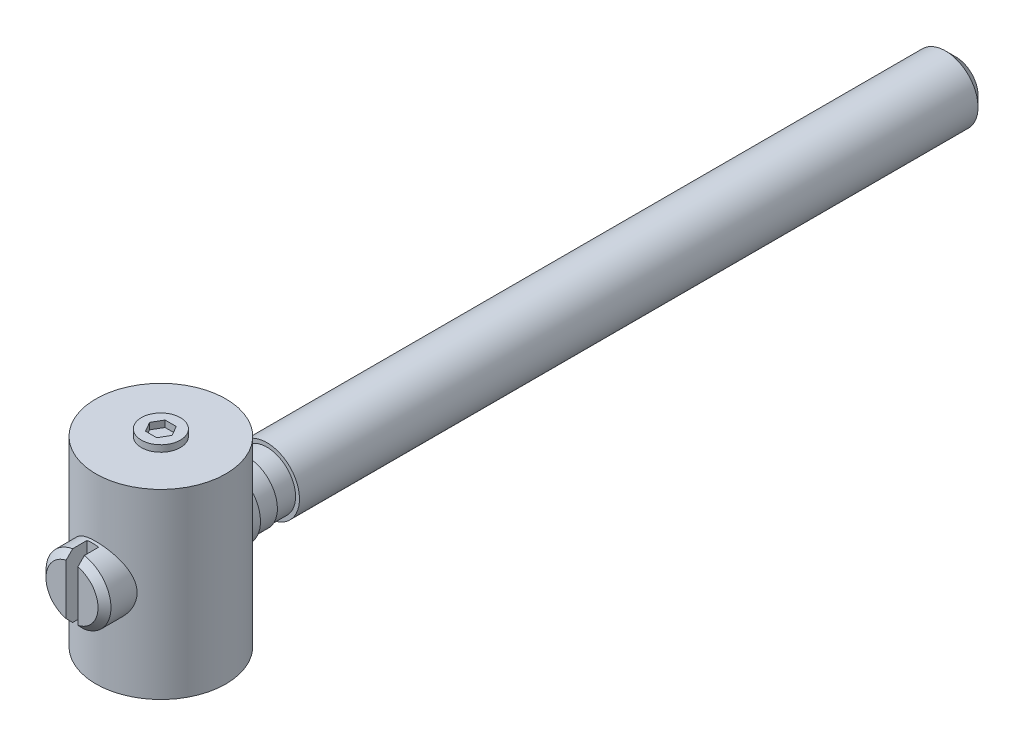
ISO-10303-21;
HEADER;
FILE_DESCRIPTION(('STEP AP214'),'2;1');
FILE_NAME('part.step','',(''),(''),'','','');
FILE_SCHEMA(('AUTOMOTIVE_DESIGN { 1 0 10303 214 1 1 1 1 }'));
ENDSEC;
DATA;
#1=APPLICATION_CONTEXT('core data for automotive mechanical design processes');
#2=APPLICATION_PROTOCOL_DEFINITION('international standard','automotive_design',2000,#1);
#3=PRODUCT_CONTEXT('',#1,'mechanical');
#4=PRODUCT('Part','Part','',(#3));
#5=PRODUCT_RELATED_PRODUCT_CATEGORY('part','',(#4));
#6=PRODUCT_DEFINITION_FORMATION('','',#4);
#7=PRODUCT_DEFINITION_CONTEXT('part definition',#1,'design');
#8=PRODUCT_DEFINITION('design','',#6,#7);
#9=PRODUCT_DEFINITION_SHAPE('','',#8);
#10=(LENGTH_UNIT() NAMED_UNIT(*) SI_UNIT(.MILLI.,.METRE.));
#11=(NAMED_UNIT(*) PLANE_ANGLE_UNIT() SI_UNIT($,.RADIAN.));
#12=(NAMED_UNIT(*) SI_UNIT($,.STERADIAN.) SOLID_ANGLE_UNIT());
#13=UNCERTAINTY_MEASURE_WITH_UNIT(LENGTH_MEASURE(1.E-05),#10,'distance_accuracy_value','');
#14=(GEOMETRIC_REPRESENTATION_CONTEXT(3) GLOBAL_UNCERTAINTY_ASSIGNED_CONTEXT((#13)) GLOBAL_UNIT_ASSIGNED_CONTEXT((#10,
#11,#12)) REPRESENTATION_CONTEXT('',''));
#15=CARTESIAN_POINT('',(0.,0.,0.));
#16=DIRECTION('',(0.,0.,1.));
#17=DIRECTION('',(1.,0.,0.));
#18=AXIS2_PLACEMENT_3D('',#15,#16,#17);
#19=CARTESIAN_POINT('',(0.,0.,6.8376561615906));
#20=DIRECTION('',(0.,0.,-1.));
#21=DIRECTION('',(0.,1.,0.));
#22=AXIS2_PLACEMENT_3D('',#19,#20,#21);
#23=PLANE('',#22);
#24=CARTESIAN_POINT('',(0.,0.,6.8376561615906));
#25=DIRECTION('',(0.,0.,-1.));
#26=DIRECTION('',(0.,1.,0.));
#27=AXIS2_PLACEMENT_3D('',#24,#25,#26);
#28=CIRCLE('',#27,2.);
#29=CARTESIAN_POINT('',(0.45,-1.94871752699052,6.8376561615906));
#30=VERTEX_POINT('',#29);
#31=CARTESIAN_POINT('',(0.45,1.94871752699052,6.8376561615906));
#32=VERTEX_POINT('',#31);
#33=EDGE_CURVE('E145',#30,#32,#28,.F.);
#34=ORIENTED_EDGE('',*,*,#33,.T.);
#35=DIRECTION('',(0.,1.,0.));
#36=VECTOR('',#35,1.);
#37=CARTESIAN_POINT('',(0.45,2.4591665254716,6.8376561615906));
#38=LINE('',#37,#36);
#39=EDGE_CURVE('E33',#30,#32,#38,.T.);
#40=ORIENTED_EDGE('',*,*,#39,.F.);
#41=EDGE_LOOP('',(#34,#40));
#42=FACE_BOUND('',#41,.T.);
#43=ADVANCED_FACE('F14',(#42),#23,.F.);
#44=CARTESIAN_POINT('',(-0.45,1.94871752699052,6.8376561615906));
#45=VERTEX_POINT('',#44);
#46=CARTESIAN_POINT('',(-0.45,-1.94871752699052,6.8376561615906));
#47=VERTEX_POINT('',#46);
#48=EDGE_CURVE('E134',#45,#47,#28,.F.);
#49=ORIENTED_EDGE('',*,*,#48,.T.);
#50=DIRECTION('',(0.,-1.,0.));
#51=VECTOR('',#50,1.);
#52=CARTESIAN_POINT('',(-0.45,2.4591665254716,6.8376561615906));
#53=LINE('',#52,#51);
#54=EDGE_CURVE('E297',#45,#47,#53,.T.);
#55=ORIENTED_EDGE('',*,*,#54,.F.);
#56=EDGE_LOOP('',(#49,#55));
#57=FACE_BOUND('',#56,.T.);
#58=ADVANCED_FACE('F181',(#57),#23,.F.);
#59=CARTESIAN_POINT('',(0.,0.,6.8376561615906));
#60=DIRECTION('',(0.,0.,-1.));
#61=DIRECTION('',(0.,1.,0.));
#62=AXIS2_PLACEMENT_3D('',#59,#60,#61);
#63=CONICAL_SURFACE('',#62,2.,0.785398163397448);
#64=CARTESIAN_POINT('',(0.45,-5.42557622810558,3.39345030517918));
#65=CARTESIAN_POINT('',(0.450000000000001,-5.23197486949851,3.58638323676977));
#66=CARTESIAN_POINT('',(0.450000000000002,-5.03834381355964,3.77928640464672));
#67=CARTESIAN_POINT('',(0.450000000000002,-4.6509706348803,4.16500261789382));
#68=CARTESIAN_POINT('',(0.450000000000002,-4.45722850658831,4.3578156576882));
#69=CARTESIAN_POINT('',(0.450000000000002,-4.06948715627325,4.74341479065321));
#70=CARTESIAN_POINT('',(0.450000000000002,-3.87548784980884,4.93620079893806));
#71=CARTESIAN_POINT('',(0.450000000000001,-3.48727998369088,5.32154115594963));
#72=CARTESIAN_POINT('',(0.450000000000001,-3.29307143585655,5.51409551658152));
#73=CARTESIAN_POINT('',(0.450000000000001,-2.91518099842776,5.88806787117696));
#74=CARTESIAN_POINT('',(0.450000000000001,-2.73151868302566,6.06950562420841));
#75=CARTESIAN_POINT('',(0.450000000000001,-2.45557699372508,6.34123708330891));
#76=CARTESIAN_POINT('',(0.450000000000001,-2.36351424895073,6.43175069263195));
#77=CARTESIAN_POINT('',(0.450000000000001,-2.17918444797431,6.61256698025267));
#78=CARTESIAN_POINT('',(0.450000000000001,-2.08691739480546,6.7028696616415));
#79=CARTESIAN_POINT('',(0.450000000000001,-1.90209588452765,6.88316070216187));
#80=CARTESIAN_POINT('',(0.450000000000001,-1.80954145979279,6.97314909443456));
#81=CARTESIAN_POINT('',(0.450000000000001,-1.62396889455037,7.15265715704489));
#82=CARTESIAN_POINT('',(0.450000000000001,-1.53095072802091,7.2421768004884));
#83=CARTESIAN_POINT('',(0.450000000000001,-1.34419825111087,7.42041554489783));
#84=CARTESIAN_POINT('',(0.450000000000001,-1.25046415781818,7.50913487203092));
#85=CARTESIAN_POINT('',(0.450000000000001,-1.10883677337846,7.64110521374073));
#86=CARTESIAN_POINT('',(0.450000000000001,-1.06145881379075,7.68490855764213));
#87=CARTESIAN_POINT('',(0.450000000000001,-0.966208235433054,7.77197331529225));
#88=CARTESIAN_POINT('',(0.45,-0.918335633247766,7.81523474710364));
#89=CARTESIAN_POINT('',(0.45,-0.843045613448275,7.88210740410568));
#90=CARTESIAN_POINT('',(0.450000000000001,-0.81588055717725,7.90600247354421));
#91=CARTESIAN_POINT('',(0.450000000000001,-0.761250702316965,7.95345109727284));
#92=CARTESIAN_POINT('',(0.450000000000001,-0.733785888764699,7.97700463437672));
#93=CARTESIAN_POINT('',(0.450000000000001,-0.678493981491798,8.02363326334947));
#94=CARTESIAN_POINT('',(0.450000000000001,-0.650667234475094,8.04670876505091));
#95=CARTESIAN_POINT('',(0.450000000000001,-0.594503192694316,8.09222815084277));
#96=CARTESIAN_POINT('',(0.45,-0.566165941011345,8.11467208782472));
#97=CARTESIAN_POINT('',(0.45,-0.508352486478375,8.15900200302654));
#98=CARTESIAN_POINT('',(0.450000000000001,-0.478865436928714,8.18087393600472));
#99=CARTESIAN_POINT('',(0.450000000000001,-0.418849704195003,8.22326079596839));
#100=CARTESIAN_POINT('',(0.450000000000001,-0.388319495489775,8.24377359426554));
#101=CARTESIAN_POINT('',(0.450000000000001,-0.32616938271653,8.28241108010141));
#102=CARTESIAN_POINT('',(0.450000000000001,-0.294562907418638,8.30055698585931));
#103=CARTESIAN_POINT('',(0.45,-0.229579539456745,8.33325387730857));
#104=CARTESIAN_POINT('',(0.45,-0.19620874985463,8.34781638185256));
#105=CARTESIAN_POINT('',(0.45,-0.135363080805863,8.36839183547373));
#106=CARTESIAN_POINT('',(0.450000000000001,-0.10831047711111,8.3756033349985));
#107=CARTESIAN_POINT('',(0.450000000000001,-0.0534100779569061,8.38529470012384));
#108=CARTESIAN_POINT('',(0.45,-0.0255652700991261,8.3877904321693));
#109=CARTESIAN_POINT('',(0.45,0.030182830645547,8.38751005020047));
#110=CARTESIAN_POINT('',(0.450000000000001,0.058086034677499,8.38471745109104));
#111=CARTESIAN_POINT('',(0.450000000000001,0.113057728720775,8.37446707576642));
#112=CARTESIAN_POINT('',(0.45,0.14012323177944,8.36699426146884));
#113=CARTESIAN_POINT('',(0.45,0.195788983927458,8.34767787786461));
#114=CARTESIAN_POINT('',(0.45,0.224253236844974,8.33545861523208));
#115=CARTESIAN_POINT('',(0.450000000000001,0.279866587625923,8.30828364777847));
#116=CARTESIAN_POINT('',(0.450000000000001,0.307012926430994,8.293322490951));
#117=CARTESIAN_POINT('',(0.450000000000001,0.360452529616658,8.26149435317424));
#118=CARTESIAN_POINT('',(0.450000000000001,0.386736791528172,8.24461251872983));
#119=CARTESIAN_POINT('',(0.45,0.438454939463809,8.20965869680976));
#120=CARTESIAN_POINT('',(0.45,0.463889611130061,8.19158785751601));
#121=CARTESIAN_POINT('',(0.45,0.516620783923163,8.15278577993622));
#122=CARTESIAN_POINT('',(0.45,0.543853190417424,8.13196802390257));
#123=CARTESIAN_POINT('',(0.450000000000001,0.597765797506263,8.08962702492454));
#124=CARTESIAN_POINT('',(0.45,0.624445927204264,8.06810369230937));
#125=CARTESIAN_POINT('',(0.45,0.703891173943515,8.00276414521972));
#126=CARTESIAN_POINT('',(0.45,0.75603674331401,7.95819695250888));
#127=CARTESIAN_POINT('',(0.45,0.859426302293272,7.86786663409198));
#128=CARTESIAN_POINT('',(0.45,0.910668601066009,7.82210159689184));
#129=CARTESIAN_POINT('',(0.45,1.01249538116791,7.72987380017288));
#130=CARTESIAN_POINT('',(0.45,1.06308003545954,7.68341123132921));
#131=CARTESIAN_POINT('',(0.45,1.16360564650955,7.59020812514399));
#132=CARTESIAN_POINT('',(0.45,1.21354839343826,7.54346951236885));
#133=CARTESIAN_POINT('',(0.45,1.31312844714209,7.44966163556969));
#134=CARTESIAN_POINT('',(0.45,1.3627657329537,7.4025923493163));
#135=CARTESIAN_POINT('',(0.45,1.51124171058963,7.26112807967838));
#136=CARTESIAN_POINT('',(0.45,1.6097456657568,7.16638213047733));
#137=CARTESIAN_POINT('',(0.45,1.8645669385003,6.91997152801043));
#138=CARTESIAN_POINT('',(0.45,2.02049383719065,6.76790421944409));
#139=CARTESIAN_POINT('',(0.45,2.33171348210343,6.46311867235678));
#140=CARTESIAN_POINT('',(0.45,2.48700621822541,6.3104004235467));
#141=CARTESIAN_POINT('',(0.45,2.79729282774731,6.00451859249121));
#142=CARTESIAN_POINT('',(0.45,2.9522865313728,5.85135483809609));
#143=CARTESIAN_POINT('',(0.45,3.26204211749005,5.54479507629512));
#144=CARTESIAN_POINT('',(0.45,3.41680400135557,5.3913990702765));
#145=CARTESIAN_POINT('',(0.45,3.88099551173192,4.93085423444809));
#146=CARTESIAN_POINT('',(0.45,4.19019976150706,4.62347828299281));
#147=CARTESIAN_POINT('',(0.449999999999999,4.65370644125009,4.16226681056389));
#148=CARTESIAN_POINT('',(0.449999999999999,4.80812040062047,4.0085432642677));
#149=CARTESIAN_POINT('',(0.449999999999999,5.116888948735,3.70103724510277));
#150=CARTESIAN_POINT('',(0.45,5.27124353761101,3.54725477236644));
#151=CARTESIAN_POINT('',(0.45,5.42557622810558,3.39345030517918));
#152=B_SPLINE_CURVE_WITH_KNOTS('',3,(#64,#65,#66,#67,#68,#69,#70,#71,#72,#73,#74,#75,#76,#77,
#78,#79,#80,#81,#82,#83,#84,#85,#86,#87,#88,#89,#90,#91,#92,#93,#94,#95,#96,#97,#98,#99,#100,
#101,#102,#103,#104,#105,#106,#107,#108,#109,#110,#111,#112,#113,#114,#115,#116,#117,#118,#119,
#120,#121,#122,#123,#124,#125,#126,#127,#128,#129,#130,#131,#132,#133,#134,#135,#136,#137,#138,
#139,#140,#141,#142,#143,#144,#145,#146,#147,#148,#149,#150,#151),.UNSPECIFIED.,.F.,.F.,(4,2,2,
2,2,2,2,2,2,2,2,2,2,2,2,2,2,2,2,2,2,2,2,2,2,2,2,2,2,2,2,2,2,2,2,2,2,2,2,2,2,2,2,4),(0.,
0.819964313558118,1.63997398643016,2.4604734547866,3.28092878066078,4.05543648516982,
4.44275311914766,4.83006404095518,5.21733280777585,5.60462355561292,5.99180119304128,
6.18537215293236,6.37893664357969,6.48747135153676,6.59601150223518,6.70445438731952,
6.81288816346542,6.92300307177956,7.03328655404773,7.14250119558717,7.25136004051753,
7.33503215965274,7.41842225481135,7.50207272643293,7.58599336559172,7.67870028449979,
7.77159358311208,7.86526158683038,7.95884042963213,8.06165788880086,8.16448846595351,
8.37024155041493,8.57634583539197,8.78239477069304,8.98759769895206,9.192814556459,
9.60283291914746,10.2562345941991,10.9096466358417,11.5633584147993,12.2170663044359,
13.5250356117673,14.1786956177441,14.8323541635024),.UNSPECIFIED.);
#153=CARTESIAN_POINT('',(0.45,-2.4591665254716,6.3376561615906));
#154=VERTEX_POINT('',#153);
#155=EDGE_CURVE('E161',#154,#30,#152,.T.);
#156=ORIENTED_EDGE('',*,*,#155,.F.);
#157=CARTESIAN_POINT('',(0.,0.,6.3376561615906));
#158=DIRECTION('',(0.,0.,-1.));
#159=DIRECTION('',(0.,1.,0.));
#160=AXIS2_PLACEMENT_3D('',#157,#158,#159);
#161=CIRCLE('',#160,2.5);
#162=CARTESIAN_POINT('',(0.45,2.4591665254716,6.3376561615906));
#163=VERTEX_POINT('',#162);
#164=EDGE_CURVE('E141',#163,#154,#161,.T.);
#165=ORIENTED_EDGE('',*,*,#164,.F.);
#166=EDGE_CURVE('E154',#32,#163,#152,.T.);
#167=ORIENTED_EDGE('',*,*,#166,.F.);
#168=ORIENTED_EDGE('',*,*,#33,.F.);
#169=EDGE_LOOP('',(#156,#165,#167,#168));
#170=FACE_BOUND('',#169,.T.);
#171=ADVANCED_FACE('F168',(#170),#63,.T.);
#172=CARTESIAN_POINT('',(0.45,2.4591665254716,5.2376561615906));
#173=DIRECTION('',(1.,0.,0.));
#174=DIRECTION('',(0.,1.,0.));
#175=AXIS2_PLACEMENT_3D('',#172,#173,#174);
#176=PLANE('',#175);
#177=ORIENTED_EDGE('',*,*,#155,.T.);
#178=ORIENTED_EDGE('',*,*,#39,.T.);
#179=ORIENTED_EDGE('',*,*,#166,.T.);
#180=DIRECTION('',(0.,0.,1.));
#181=VECTOR('',#180,1.);
#182=CARTESIAN_POINT('',(0.45,2.4591665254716,5.2376561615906));
#183=LINE('',#182,#181);
#184=CARTESIAN_POINT('',(0.45,2.4591665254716,5.2376561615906));
#185=VERTEX_POINT('',#184);
#186=EDGE_CURVE('E125',#185,#163,#183,.T.);
#187=ORIENTED_EDGE('',*,*,#186,.F.);
#188=DIRECTION('',(0.,1.,0.));
#189=VECTOR('',#188,1.);
#190=CARTESIAN_POINT('',(0.45,2.4591665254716,5.2376561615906));
#191=LINE('',#190,#189);
#192=CARTESIAN_POINT('',(0.45,-2.4591665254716,5.2376561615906));
#193=VERTEX_POINT('',#192);
#194=EDGE_CURVE('E89',#193,#185,#191,.T.);
#195=ORIENTED_EDGE('',*,*,#194,.F.);
#196=DIRECTION('',(0.,0.,1.));
#197=VECTOR('',#196,1.);
#198=CARTESIAN_POINT('',(0.45,-2.4591665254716,5.2376561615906));
#199=LINE('',#198,#197);
#200=EDGE_CURVE('E308',#193,#154,#199,.T.);
#201=ORIENTED_EDGE('',*,*,#200,.T.);
#202=EDGE_LOOP('',(#177,#178,#179,#187,#195,#201));
#203=FACE_BOUND('',#202,.T.);
#204=ADVANCED_FACE('F172',(#203),#176,.F.);
#205=CARTESIAN_POINT('',(0.,0.,5.2376561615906));
#206=DIRECTION('',(0.,0.,1.));
#207=DIRECTION('',(0.,-1.,0.));
#208=AXIS2_PLACEMENT_3D('',#205,#206,#207);
#209=PLANE('',#208);
#210=CARTESIAN_POINT('',(0.,0.,5.2376561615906));
#211=DIRECTION('',(0.,0.,1.));
#212=DIRECTION('',(0.,-1.,0.));
#213=AXIS2_PLACEMENT_3D('',#210,#211,#212);
#214=CIRCLE('',#213,2.5);
#215=CARTESIAN_POINT('',(-0.45,-2.4591665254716,5.2376561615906));
#216=VERTEX_POINT('',#215);
#217=EDGE_CURVE('E299',#216,#193,#214,.T.);
#218=ORIENTED_EDGE('',*,*,#217,.T.);
#219=ORIENTED_EDGE('',*,*,#194,.T.);
#220=CARTESIAN_POINT('',(0.,0.,5.2376561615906));
#221=DIRECTION('',(0.,0.,1.));
#222=DIRECTION('',(0.,-1.,0.));
#223=AXIS2_PLACEMENT_3D('',#220,#221,#222);
#224=CIRCLE('',#223,2.5);
#225=CARTESIAN_POINT('',(-0.45,2.4591665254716,5.2376561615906));
#226=VERTEX_POINT('',#225);
#227=EDGE_CURVE('E333',#185,#226,#224,.T.);
#228=ORIENTED_EDGE('',*,*,#227,.T.);
#229=DIRECTION('',(0.,-1.,0.));
#230=VECTOR('',#229,1.);
#231=CARTESIAN_POINT('',(-0.45,2.4591665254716,5.2376561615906));
#232=LINE('',#231,#230);
#233=EDGE_CURVE('E120',#226,#216,#232,.T.);
#234=ORIENTED_EDGE('',*,*,#233,.T.);
#235=EDGE_LOOP('',(#218,#219,#228,#234));
#236=FACE_BOUND('',#235,.T.);
#237=ADVANCED_FACE('F176',(#236),#209,.T.);
#238=CARTESIAN_POINT('',(-0.45,2.4591665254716,5.2376561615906));
#239=DIRECTION('',(-1.,0.,0.));
#240=DIRECTION('',(0.,-1.,0.));
#241=AXIS2_PLACEMENT_3D('',#238,#239,#240);
#242=PLANE('',#241);
#243=CARTESIAN_POINT('',(-0.45,5.42557622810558,3.39345030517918));
#244=CARTESIAN_POINT('',(-0.45,5.23197486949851,3.58638323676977));
#245=CARTESIAN_POINT('',(-0.45,5.03834381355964,3.77928640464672));
#246=CARTESIAN_POINT('',(-0.45,4.6509706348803,4.16500261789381));
#247=CARTESIAN_POINT('',(-0.45,4.45722850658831,4.3578156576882));
#248=CARTESIAN_POINT('',(-0.45,4.06948715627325,4.74341479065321));
#249=CARTESIAN_POINT('',(-0.45,3.87548784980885,4.93620079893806));
#250=CARTESIAN_POINT('',(-0.45,3.48727998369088,5.32154115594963));
#251=CARTESIAN_POINT('',(-0.45,3.29307143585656,5.51409551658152));
#252=CARTESIAN_POINT('',(-0.45,2.91518099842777,5.88806787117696));
#253=CARTESIAN_POINT('',(-0.45,2.73151868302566,6.06950562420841));
#254=CARTESIAN_POINT('',(-0.45,2.45557699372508,6.34123708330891));
#255=CARTESIAN_POINT('',(-0.45,2.36351424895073,6.43175069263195));
#256=CARTESIAN_POINT('',(-0.45,2.17918444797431,6.61256698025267));
#257=CARTESIAN_POINT('',(-0.45,2.08691739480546,6.7028696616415));
#258=CARTESIAN_POINT('',(-0.45,1.90209588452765,6.88316070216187));
#259=CARTESIAN_POINT('',(-0.45,1.80954145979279,6.97314909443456));
#260=CARTESIAN_POINT('',(-0.45,1.62396889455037,7.15265715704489));
#261=CARTESIAN_POINT('',(-0.45,1.53095072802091,7.2421768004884));
#262=CARTESIAN_POINT('',(-0.45,1.34419825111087,7.42041554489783));
#263=CARTESIAN_POINT('',(-0.45,1.25046415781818,7.50913487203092));
#264=CARTESIAN_POINT('',(-0.45,1.10883677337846,7.64110521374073));
#265=CARTESIAN_POINT('',(-0.45,1.06145881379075,7.68490855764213));
#266=CARTESIAN_POINT('',(-0.45,0.966208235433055,7.77197331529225));
#267=CARTESIAN_POINT('',(-0.45,0.918335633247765,7.81523474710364));
#268=CARTESIAN_POINT('',(-0.45,0.843045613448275,7.88210740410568));
#269=CARTESIAN_POINT('',(-0.45,0.81588055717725,7.90600247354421));
#270=CARTESIAN_POINT('',(-0.45,0.761250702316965,7.95345109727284));
#271=CARTESIAN_POINT('',(-0.45,0.733785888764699,7.97700463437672));
#272=CARTESIAN_POINT('',(-0.45,0.678493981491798,8.02363326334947));
#273=CARTESIAN_POINT('',(-0.45,0.650667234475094,8.04670876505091));
#274=CARTESIAN_POINT('',(-0.45,0.594503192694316,8.09222815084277));
#275=CARTESIAN_POINT('',(-0.45,0.566165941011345,8.11467208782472));
#276=CARTESIAN_POINT('',(-0.45,0.508352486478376,8.15900200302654));
#277=CARTESIAN_POINT('',(-0.45,0.478865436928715,8.18087393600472));
#278=CARTESIAN_POINT('',(-0.45,0.418849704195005,8.22326079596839));
#279=CARTESIAN_POINT('',(-0.45,0.388319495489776,8.24377359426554));
#280=CARTESIAN_POINT('',(-0.45,0.326169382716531,8.28241108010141));
#281=CARTESIAN_POINT('',(-0.45,0.294562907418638,8.30055698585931));
#282=CARTESIAN_POINT('',(-0.45,0.229579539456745,8.33325387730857));
#283=CARTESIAN_POINT('',(-0.45,0.19620874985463,8.34781638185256));
#284=CARTESIAN_POINT('',(-0.45,0.135363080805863,8.36839183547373));
#285=CARTESIAN_POINT('',(-0.45,0.10831047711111,8.3756033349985));
#286=CARTESIAN_POINT('',(-0.45,0.0534100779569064,8.38529470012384));
#287=CARTESIAN_POINT('',(-0.45,0.0255652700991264,8.38779043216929));
#288=CARTESIAN_POINT('',(-0.45,-0.030182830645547,8.38751005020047));
#289=CARTESIAN_POINT('',(-0.45,-0.0580860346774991,8.38471745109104));
#290=CARTESIAN_POINT('',(-0.45,-0.113057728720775,8.37446707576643));
#291=CARTESIAN_POINT('',(-0.45,-0.140123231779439,8.36699426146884));
#292=CARTESIAN_POINT('',(-0.45,-0.195788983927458,8.34767787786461));
#293=CARTESIAN_POINT('',(-0.45,-0.224253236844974,8.33545861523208));
#294=CARTESIAN_POINT('',(-0.45,-0.279866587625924,8.30828364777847));
#295=CARTESIAN_POINT('',(-0.45,-0.307012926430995,8.293322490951));
#296=CARTESIAN_POINT('',(-0.45,-0.360452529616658,8.26149435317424));
#297=CARTESIAN_POINT('',(-0.45,-0.386736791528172,8.24461251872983));
#298=CARTESIAN_POINT('',(-0.45,-0.43845493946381,8.20965869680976));
#299=CARTESIAN_POINT('',(-0.45,-0.463889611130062,8.19158785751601));
#300=CARTESIAN_POINT('',(-0.45,-0.516620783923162,8.15278577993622));
#301=CARTESIAN_POINT('',(-0.45,-0.543853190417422,8.13196802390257));
#302=CARTESIAN_POINT('',(-0.45,-0.597765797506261,8.08962702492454));
#303=CARTESIAN_POINT('',(-0.45,-0.624445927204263,8.06810369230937));
#304=CARTESIAN_POINT('',(-0.45,-0.703891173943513,8.00276414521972));
#305=CARTESIAN_POINT('',(-0.45,-0.756036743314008,7.95819695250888));
#306=CARTESIAN_POINT('',(-0.45,-0.859426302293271,7.86786663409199));
#307=CARTESIAN_POINT('',(-0.45,-0.910668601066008,7.82210159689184));
#308=CARTESIAN_POINT('',(-0.45,-1.01249538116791,7.72987380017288));
#309=CARTESIAN_POINT('',(-0.45,-1.06308003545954,7.68341123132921));
#310=CARTESIAN_POINT('',(-0.45,-1.16360564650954,7.59020812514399));
#311=CARTESIAN_POINT('',(-0.45,-1.21354839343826,7.54346951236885));
#312=CARTESIAN_POINT('',(-0.45,-1.31312844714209,7.44966163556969));
#313=CARTESIAN_POINT('',(-0.45,-1.3627657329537,7.4025923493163));
#314=CARTESIAN_POINT('',(-0.45,-1.51124171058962,7.26112807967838));
#315=CARTESIAN_POINT('',(-0.45,-1.60974566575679,7.16638213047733));
#316=CARTESIAN_POINT('',(-0.45,-1.8645669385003,6.91997152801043));
#317=CARTESIAN_POINT('',(-0.45,-2.02049383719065,6.7679042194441));
#318=CARTESIAN_POINT('',(-0.45,-2.33171348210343,6.46311867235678));
#319=CARTESIAN_POINT('',(-0.45,-2.48700621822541,6.3104004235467));
#320=CARTESIAN_POINT('',(-0.45,-2.79729282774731,6.00451859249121));
#321=CARTESIAN_POINT('',(-0.45,-2.95228653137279,5.85135483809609));
#322=CARTESIAN_POINT('',(-0.45,-3.26204211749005,5.54479507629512));
#323=CARTESIAN_POINT('',(-0.45,-3.41680400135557,5.3913990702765));
#324=CARTESIAN_POINT('',(-0.45,-3.88099551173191,4.93085423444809));
#325=CARTESIAN_POINT('',(-0.45,-4.19019976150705,4.62347828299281));
#326=CARTESIAN_POINT('',(-0.45,-4.65370644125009,4.16226681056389));
#327=CARTESIAN_POINT('',(-0.45,-4.80812040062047,4.0085432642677));
#328=CARTESIAN_POINT('',(-0.45,-5.116888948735,3.70103724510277));
#329=CARTESIAN_POINT('',(-0.45,-5.27124353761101,3.54725477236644));
#330=CARTESIAN_POINT('',(-0.45,-5.42557622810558,3.39345030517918));
#331=B_SPLINE_CURVE_WITH_KNOTS('',3,(#243,#244,#245,#246,#247,#248,#249,#250,#251,#252,#253,
#254,#255,#256,#257,#258,#259,#260,#261,#262,#263,#264,#265,#266,#267,#268,#269,#270,#271,#272,
#273,#274,#275,#276,#277,#278,#279,#280,#281,#282,#283,#284,#285,#286,#287,#288,#289,#290,#291,
#292,#293,#294,#295,#296,#297,#298,#299,#300,#301,#302,#303,#304,#305,#306,#307,#308,#309,#310,
#311,#312,#313,#314,#315,#316,#317,#318,#319,#320,#321,#322,#323,#324,#325,#326,#327,#328,#329,
#330),.UNSPECIFIED.,.F.,.F.,(4,2,2,2,2,2,2,2,2,2,2,2,2,2,2,2,2,2,2,2,2,2,2,2,2,2,2,2,2,2,2,2,2,
2,2,2,2,2,2,2,2,2,2,4),(0.,0.819964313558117,1.63997398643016,2.4604734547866,3.28092878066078,
4.05543648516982,4.44275311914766,4.83006404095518,5.21733280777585,5.60462355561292,
5.99180119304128,6.18537215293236,6.37893664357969,6.48747135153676,6.59601150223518,
6.70445438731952,6.81288816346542,6.92300307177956,7.03328655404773,7.14250119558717,
7.25136004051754,7.33503215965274,7.41842225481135,7.50207272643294,7.58599336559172,
7.6787002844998,7.77159358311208,7.86526158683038,7.95884042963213,8.06165788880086,
8.16448846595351,8.37024155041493,8.57634583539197,8.78239477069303,8.98759769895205,
9.192814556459,9.60283291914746,10.2562345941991,10.9096466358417,11.5633584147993,
12.2170663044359,13.5250356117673,14.1786956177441,14.8323541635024),.UNSPECIFIED.);
#332=CARTESIAN_POINT('',(-0.45,2.4591665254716,6.3376561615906));
#333=VERTEX_POINT('',#332);
#334=EDGE_CURVE('E117',#333,#45,#331,.T.);
#335=ORIENTED_EDGE('',*,*,#334,.T.);
#336=ORIENTED_EDGE('',*,*,#54,.T.);
#337=CARTESIAN_POINT('',(-0.45,-2.4591665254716,6.3376561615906));
#338=VERTEX_POINT('',#337);
#339=EDGE_CURVE('E135',#47,#338,#331,.T.);
#340=ORIENTED_EDGE('',*,*,#339,.T.);
#341=DIRECTION('',(0.,0.,1.));
#342=VECTOR('',#341,1.);
#343=CARTESIAN_POINT('',(-0.45,-2.4591665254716,5.2376561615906));
#344=LINE('',#343,#342);
#345=EDGE_CURVE('E124',#216,#338,#344,.T.);
#346=ORIENTED_EDGE('',*,*,#345,.F.);
#347=ORIENTED_EDGE('',*,*,#233,.F.);
#348=DIRECTION('',(0.,0.,1.));
#349=VECTOR('',#348,1.);
#350=CARTESIAN_POINT('',(-0.45,2.4591665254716,5.2376561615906));
#351=LINE('',#350,#349);
#352=EDGE_CURVE('E114',#226,#333,#351,.T.);
#353=ORIENTED_EDGE('',*,*,#352,.T.);
#354=EDGE_LOOP('',(#335,#336,#340,#346,#347,#353));
#355=FACE_BOUND('',#354,.T.);
#356=ADVANCED_FACE('F116',(#355),#242,.F.);
#357=ORIENTED_EDGE('',*,*,#334,.F.);
#358=EDGE_CURVE('E132',#338,#333,#161,.T.);
#359=ORIENTED_EDGE('',*,*,#358,.F.);
#360=ORIENTED_EDGE('',*,*,#339,.F.);
#361=ORIENTED_EDGE('',*,*,#48,.F.);
#362=EDGE_LOOP('',(#357,#359,#360,#361));
#363=FACE_BOUND('',#362,.T.);
#364=ADVANCED_FACE('F130',(#363),#63,.T.);
#365=CARTESIAN_POINT('',(0.,0.,37.1330220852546));
#366=DIRECTION('',(0.,0.,1.));
#367=DIRECTION('',(0.,-1.,0.));
#368=AXIS2_PLACEMENT_3D('',#365,#366,#367);
#369=CYLINDRICAL_SURFACE('',#368,2.5);
#370=ORIENTED_EDGE('',*,*,#358,.T.);
#371=ORIENTED_EDGE('',*,*,#352,.F.);
#372=ORIENTED_EDGE('',*,*,#227,.F.);
#373=ORIENTED_EDGE('',*,*,#186,.T.);
#374=ORIENTED_EDGE('',*,*,#164,.T.);
#375=ORIENTED_EDGE('',*,*,#200,.F.);
#376=ORIENTED_EDGE('',*,*,#217,.F.);
#377=ORIENTED_EDGE('',*,*,#345,.T.);
#378=EDGE_LOOP('',(#370,#371,#372,#373,#374,#375,#376,#377));
#379=FACE_BOUND('',#378,.T.);
#380=CARTESIAN_POINT('',(0.,-2.5,5.));
#381=CARTESIAN_POINT('',(-0.131426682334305,-2.49999033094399,4.99999177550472));
#382=CARTESIAN_POINT('',(-0.263015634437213,-2.48957443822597,4.99476199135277));
#383=CARTESIAN_POINT('',(-0.522301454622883,-2.44836817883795,4.9743541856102));
#384=CARTESIAN_POINT('',(-0.649990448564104,-2.41753911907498,4.9591572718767));
#385=CARTESIAN_POINT('',(-0.897333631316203,-2.33701537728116,4.92040690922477));
#386=CARTESIAN_POINT('',(-1.01701694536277,-2.28739401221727,4.89688595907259));
#387=CARTESIAN_POINT('',(-1.24618160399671,-2.1710734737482,4.84364443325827));
#388=CARTESIAN_POINT('',(-1.3556637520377,-2.10437564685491,4.81392434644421));
#389=CARTESIAN_POINT('',(-1.56876952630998,-1.95120686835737,4.74890645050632));
#390=CARTESIAN_POINT('',(-1.67163802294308,-1.86378379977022,4.71337997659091));
#391=CARTESIAN_POINT('',(-1.86194861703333,-1.67369630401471,4.64149925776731));
#392=CARTESIAN_POINT('',(-1.94937895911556,-1.57102037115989,4.60514440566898));
#393=CARTESIAN_POINT('',(-2.11312999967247,-1.34379162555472,4.53247377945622));
#394=CARTESIAN_POINT('',(-2.18806333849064,-1.21815975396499,4.49637967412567));
#395=CARTESIAN_POINT('',(-2.31542056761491,-0.954081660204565,4.43214946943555));
#396=CARTESIAN_POINT('',(-2.36786053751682,-0.815644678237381,4.40400769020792));
#397=CARTESIAN_POINT('',(-2.44533110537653,-0.538337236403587,4.36144667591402));
#398=CARTESIAN_POINT('',(-2.47181464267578,-0.399988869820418,4.34630678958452));
#399=CARTESIAN_POINT('',(-2.50106748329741,-0.120052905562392,4.3295472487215));
#400=CARTESIAN_POINT('',(-2.50386022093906,0.0215313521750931,4.3279142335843));
#401=CARTESIAN_POINT('',(-2.48671821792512,0.285715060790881,4.33777325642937));
#402=CARTESIAN_POINT('',(-2.46946139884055,0.408560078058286,4.34771909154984));
#403=CARTESIAN_POINT('',(-2.41734962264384,0.649304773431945,4.37690571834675));
#404=CARTESIAN_POINT('',(-2.38248905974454,0.767202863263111,4.39614947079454));
#405=CARTESIAN_POINT('',(-2.29552445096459,0.998072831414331,4.44218691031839));
#406=CARTESIAN_POINT('',(-2.24303766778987,1.11086599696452,4.46914601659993));
#407=CARTESIAN_POINT('',(-2.12260421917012,1.32658573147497,4.52758510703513));
#408=CARTESIAN_POINT('',(-2.0546506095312,1.42950783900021,4.55906711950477));
#409=CARTESIAN_POINT('',(-1.89516513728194,1.63630313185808,4.62782894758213));
#410=CARTESIAN_POINT('',(-1.8017361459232,1.7386421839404,4.66533775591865));
#411=CARTESIAN_POINT('',(-1.59888894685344,1.92683854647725,4.73869058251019));
#412=CARTESIAN_POINT('',(-1.48946314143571,2.01268798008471,4.77453379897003));
#413=CARTESIAN_POINT('',(-1.25129126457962,2.16921415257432,4.84254968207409));
#414=CARTESIAN_POINT('',(-1.12188397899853,2.23900118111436,4.87447460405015));
#415=CARTESIAN_POINT('',(-0.851165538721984,2.35524257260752,4.92894702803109));
#416=CARTESIAN_POINT('',(-0.709863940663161,2.4017154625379,4.95150197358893));
#417=CARTESIAN_POINT('',(-0.431916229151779,2.46618850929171,4.98310834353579));
#418=CARTESIAN_POINT('',(-0.295853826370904,2.486228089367,4.9931234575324));
#419=CARTESIAN_POINT('',(-0.0219489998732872,2.50366182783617,5.00182533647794));
#420=CARTESIAN_POINT('',(0.11589254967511,2.50106671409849,5.00051746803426));
#421=CARTESIAN_POINT('',(0.378082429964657,2.4744832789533,4.98727980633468));
#422=CARTESIAN_POINT('',(0.502648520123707,2.45216866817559,4.97618114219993));
#423=CARTESIAN_POINT('',(0.746017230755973,2.38940482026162,4.94555428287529));
#424=CARTESIAN_POINT('',(0.864819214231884,2.34895358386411,4.92602515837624));
#425=CARTESIAN_POINT('',(1.09722152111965,2.25000383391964,4.87960628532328));
#426=CARTESIAN_POINT('',(1.21057599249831,2.19102237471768,4.85252204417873));
#427=CARTESIAN_POINT('',(1.42615340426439,2.05723116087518,4.7935993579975));
#428=CARTESIAN_POINT('',(1.52837157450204,1.98241466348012,4.76175888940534));
#429=CARTESIAN_POINT('',(1.72941922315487,1.81059893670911,4.69270553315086));
#430=CARTESIAN_POINT('',(1.82693019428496,1.7121428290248,4.65527212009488));
#431=CARTESIAN_POINT('',(2.0046408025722,1.50018712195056,4.58155978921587));
#432=CARTESIAN_POINT('',(2.08482846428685,1.38667720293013,4.54528168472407));
#433=CARTESIAN_POINT('',(2.22926978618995,1.14089086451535,4.4762798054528));
#434=CARTESIAN_POINT('',(2.29256373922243,1.00797183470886,4.44381323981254));
#435=CARTESIAN_POINT('',(2.39520706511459,0.731224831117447,4.38935180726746));
#436=CARTESIAN_POINT('',(2.43458729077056,0.587411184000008,4.36734345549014));
#437=CARTESIAN_POINT('',(2.48465421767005,0.307724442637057,4.33903752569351));
#438=CARTESIAN_POINT('',(2.4977324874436,0.172414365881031,4.33143458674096));
#439=CARTESIAN_POINT('',(2.50172288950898,-0.0986176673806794,4.32913386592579));
#440=CARTESIAN_POINT('',(2.49264462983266,-0.23433941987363,4.3344304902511));
#441=CARTESIAN_POINT('',(2.45481530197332,-0.488708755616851,4.35594655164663));
#442=CARTESIAN_POINT('',(2.42802074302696,-0.607751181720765,4.37107736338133));
#443=CARTESIAN_POINT('',(2.35793843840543,-0.839520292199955,4.40927540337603));
#444=CARTESIAN_POINT('',(2.31464538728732,-0.952244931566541,4.43234518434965));
#445=CARTESIAN_POINT('',(2.20953919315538,-1.17656215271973,4.48571326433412));
#446=CARTESIAN_POINT('',(2.14667719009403,-1.28756985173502,4.5163930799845));
#447=CARTESIAN_POINT('',(2.0053780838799,-1.49818624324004,4.58088327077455));
#448=CARTESIAN_POINT('',(1.92693287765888,-1.59778896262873,4.61469526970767));
#449=CARTESIAN_POINT('',(1.74550556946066,-1.79535536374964,4.68655816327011));
#450=CARTESIAN_POINT('',(1.6407002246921,-1.89164936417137,4.72462491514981));
#451=CARTESIAN_POINT('',(1.41539785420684,-2.06565584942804,4.79694347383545));
#452=CARTESIAN_POINT('',(1.29489242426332,-2.14335831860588,4.83119321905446));
#453=CARTESIAN_POINT('',(1.03978808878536,-2.2780969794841,4.89245149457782));
#454=CARTESIAN_POINT('',(0.905095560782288,-2.33498316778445,4.91940711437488));
#455=CARTESIAN_POINT('',(0.696328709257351,-2.4021838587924,4.95177960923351));
#456=CARTESIAN_POINT('',(0.625670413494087,-2.42155539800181,4.96122314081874));
#457=CARTESIAN_POINT('',(0.482623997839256,-2.4540659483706,4.97717127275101));
#458=CARTESIAN_POINT('',(0.4102369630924,-2.46720876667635,4.98367766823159));
#459=CARTESIAN_POINT('',(0.28151868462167,-2.48473747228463,4.9923820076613));
#460=CARTESIAN_POINT('',(0.225408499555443,-2.49045493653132,4.99523288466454));
#461=CARTESIAN_POINT('',(0.112875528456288,-2.49808832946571,4.99904367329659));
#462=CARTESIAN_POINT('',(0.0564527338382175,-2.50000415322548,5.00000353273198));
#463=CARTESIAN_POINT('',(0.,-2.5,5.));
#464=B_SPLINE_CURVE_WITH_KNOTS('',3,(#380,#381,#382,#383,#384,#385,#386,#387,#388,#389,#390,
#391,#392,#393,#394,#395,#396,#397,#398,#399,#400,#401,#402,#403,#404,#405,#406,#407,#408,#409,
#410,#411,#412,#413,#414,#415,#416,#417,#418,#419,#420,#421,#422,#423,#424,#425,#426,#427,#428,
#429,#430,#431,#432,#433,#434,#435,#436,#437,#438,#439,#440,#441,#442,#443,#444,#445,#446,#447,
#448,#449,#450,#451,#452,#453,#454,#455,#456,#457,#458,#459,#460,#461,#462,#463),.UNSPECIFIED.,
.T.,.F.,(4,2,2,2,2,2,2,2,2,2,2,2,2,2,2,2,2,2,2,2,2,2,2,2,2,2,2,2,2,2,2,2,2,2,2,2,2,2,2,2,2,4),
(0.,0.394060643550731,0.788870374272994,1.18215538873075,1.57540940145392,1.99245439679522,
2.40981559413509,2.85954316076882,3.30894869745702,3.73145030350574,4.15353393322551,
4.52514281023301,4.89687009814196,5.27725600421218,5.65781303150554,6.08662353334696,
6.51563836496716,6.96457555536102,7.41315542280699,7.82458226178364,8.2358141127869,
8.61517266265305,8.99457304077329,9.38482140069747,9.77523626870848,10.2039902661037,
10.6330397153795,11.0828670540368,11.53211279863,11.9382326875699,12.3441764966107,
12.7114482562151,13.0788382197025,13.4709114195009,13.8631890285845,14.303131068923,
14.7433095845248,15.1866003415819,15.407934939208,15.6291340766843,15.7983933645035,
15.9676573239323),.UNSPECIFIED.);
#465=CARTESIAN_POINT('',(0.,-2.5,5.));
#466=VERTEX_POINT('',#465);
#467=EDGE_CURVE('E24',#466,#466,#464,.T.);
#468=ORIENTED_EDGE('',*,*,#467,.F.);
#469=EDGE_LOOP('',(#468));
#470=FACE_BOUND('',#469,.T.);
#471=ADVANCED_FACE('F138',(#379,#470),#369,.T.);
#472=CARTESIAN_POINT('',(0.,7.,0.));
#473=DIRECTION('',(0.,1.,0.));
#474=DIRECTION('',(-1.,0.,0.));
#475=AXIS2_PLACEMENT_3D('',#472,#473,#474);
#476=PLANE('',#475);
#477=DIRECTION('',(-1.,0.,0.));
#478=VECTOR('',#477,1.);
#479=CARTESIAN_POINT('',(-0.43301270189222,7.,0.75));
#480=LINE('',#479,#478);
#481=CARTESIAN_POINT('',(0.43301270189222,7.,0.75));
#482=VERTEX_POINT('',#481);
#483=CARTESIAN_POINT('',(-0.433012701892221,7.,0.75));
#484=VERTEX_POINT('',#483);
#485=EDGE_CURVE('E561',#482,#484,#480,.T.);
#486=ORIENTED_EDGE('',*,*,#485,.F.);
#487=DIRECTION('',(-0.5,0.,0.866025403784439));
#488=VECTOR('',#487,1.);
#489=CARTESIAN_POINT('',(0.43301270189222,7.,0.75));
#490=LINE('',#489,#488);
#491=CARTESIAN_POINT('',(0.866025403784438,7.,0.));
#492=VERTEX_POINT('',#491);
#493=EDGE_CURVE('E565',#492,#482,#490,.T.);
#494=ORIENTED_EDGE('',*,*,#493,.F.);
#495=DIRECTION('',(0.5,0.,0.866025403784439));
#496=VECTOR('',#495,1.);
#497=CARTESIAN_POINT('',(0.866025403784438,7.,0.));
#498=LINE('',#497,#496);
#499=CARTESIAN_POINT('',(0.43301270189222,7.,-0.75));
#500=VERTEX_POINT('',#499);
#501=EDGE_CURVE('E263',#500,#492,#498,.T.);
#502=ORIENTED_EDGE('',*,*,#501,.F.);
#503=DIRECTION('',(1.,0.,0.));
#504=VECTOR('',#503,1.);
#505=CARTESIAN_POINT('',(0.43301270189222,7.,-0.75));
#506=LINE('',#505,#504);
#507=CARTESIAN_POINT('',(-0.43301270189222,7.,-0.75));
#508=VERTEX_POINT('',#507);
#509=EDGE_CURVE('E578',#508,#500,#506,.T.);
#510=ORIENTED_EDGE('',*,*,#509,.F.);
#511=DIRECTION('',(0.5,0.,-0.866025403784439));
#512=VECTOR('',#511,1.);
#513=CARTESIAN_POINT('',(-0.43301270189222,7.,-0.75));
#514=LINE('',#513,#512);
#515=CARTESIAN_POINT('',(-0.86602540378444,7.,0.));
#516=VERTEX_POINT('',#515);
#517=EDGE_CURVE('E81',#516,#508,#514,.T.);
#518=ORIENTED_EDGE('',*,*,#517,.F.);
#519=DIRECTION('',(-0.5,0.,-0.866025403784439));
#520=VECTOR('',#519,1.);
#521=CARTESIAN_POINT('',(-0.86602540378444,7.,0.));
#522=LINE('',#521,#520);
#523=EDGE_CURVE('E201',#484,#516,#522,.T.);
#524=ORIENTED_EDGE('',*,*,#523,.F.);
#525=EDGE_LOOP('',(#486,#494,#502,#510,#518,#524));
#526=FACE_BOUND('',#525,.T.);
#527=ADVANCED_FACE('F221',(#526),#476,.T.);
#528=CARTESIAN_POINT('',(-0.43301270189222,6.3,0.75));
#529=DIRECTION('',(0.,0.,1.));
#530=DIRECTION('',(1.,0.,0.));
#531=AXIS2_PLACEMENT_3D('',#528,#529,#530);
#532=PLANE('',#531);
#533=DIRECTION('',(0.,1.,0.));
#534=VECTOR('',#533,1.);
#535=CARTESIAN_POINT('',(0.43301270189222,6.3,0.75));
#536=LINE('',#535,#534);
#537=CARTESIAN_POINT('',(0.43301270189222,7.5,0.75));
#538=VERTEX_POINT('',#537);
#539=EDGE_CURVE('E273',#482,#538,#536,.T.);
#540=ORIENTED_EDGE('',*,*,#539,.F.);
#541=ORIENTED_EDGE('',*,*,#485,.T.);
#542=DIRECTION('',(0.,1.,0.));
#543=VECTOR('',#542,1.);
#544=CARTESIAN_POINT('',(-0.43301270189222,6.3,0.75));
#545=LINE('',#544,#543);
#546=CARTESIAN_POINT('',(-0.43301270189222,7.5,0.75));
#547=VERTEX_POINT('',#546);
#548=EDGE_CURVE('E75',#484,#547,#545,.T.);
#549=ORIENTED_EDGE('',*,*,#548,.T.);
#550=DIRECTION('',(1.,0.,0.));
#551=VECTOR('',#550,1.);
#552=CARTESIAN_POINT('',(-0.43301270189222,7.5,0.75));
#553=LINE('',#552,#551);
#554=EDGE_CURVE('E286',#547,#538,#553,.T.);
#555=ORIENTED_EDGE('',*,*,#554,.T.);
#556=EDGE_LOOP('',(#540,#541,#549,#555));
#557=FACE_BOUND('',#556,.T.);
#558=ADVANCED_FACE('F223',(#557),#532,.F.);
#559=CARTESIAN_POINT('',(0.43301270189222,6.3,0.75));
#560=DIRECTION('',(0.866025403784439,0.,0.5));
#561=DIRECTION('',(0.5,0.,-0.866025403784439));
#562=AXIS2_PLACEMENT_3D('',#559,#560,#561);
#563=PLANE('',#562);
#564=DIRECTION('',(0.,1.,0.));
#565=VECTOR('',#564,1.);
#566=CARTESIAN_POINT('',(0.866025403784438,6.3,0.));
#567=LINE('',#566,#565);
#568=CARTESIAN_POINT('',(0.866025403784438,7.5,0.));
#569=VERTEX_POINT('',#568);
#570=EDGE_CURVE('E270',#492,#569,#567,.T.);
#571=ORIENTED_EDGE('',*,*,#570,.F.);
#572=ORIENTED_EDGE('',*,*,#493,.T.);
#573=ORIENTED_EDGE('',*,*,#539,.T.);
#574=DIRECTION('',(0.5,0.,-0.866025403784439));
#575=VECTOR('',#574,1.);
#576=CARTESIAN_POINT('',(0.43301270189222,7.5,0.75));
#577=LINE('',#576,#575);
#578=EDGE_CURVE('E283',#538,#569,#577,.T.);
#579=ORIENTED_EDGE('',*,*,#578,.T.);
#580=EDGE_LOOP('',(#571,#572,#573,#579));
#581=FACE_BOUND('',#580,.T.);
#582=ADVANCED_FACE('F230',(#581),#563,.F.);
#583=CARTESIAN_POINT('',(0.866025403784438,6.3,0.));
#584=DIRECTION('',(0.866025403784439,0.,-0.5));
#585=DIRECTION('',(-0.5,0.,-0.866025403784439));
#586=AXIS2_PLACEMENT_3D('',#583,#584,#585);
#587=PLANE('',#586);
#588=DIRECTION('',(0.,1.,0.));
#589=VECTOR('',#588,1.);
#590=CARTESIAN_POINT('',(0.43301270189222,6.3,-0.75));
#591=LINE('',#590,#589);
#592=CARTESIAN_POINT('',(0.43301270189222,7.5,-0.75));
#593=VERTEX_POINT('',#592);
#594=EDGE_CURVE('E262',#500,#593,#591,.T.);
#595=ORIENTED_EDGE('',*,*,#594,.F.);
#596=ORIENTED_EDGE('',*,*,#501,.T.);
#597=ORIENTED_EDGE('',*,*,#570,.T.);
#598=DIRECTION('',(-0.5,0.,-0.866025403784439));
#599=VECTOR('',#598,1.);
#600=CARTESIAN_POINT('',(0.866025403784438,7.5,0.));
#601=LINE('',#600,#599);
#602=EDGE_CURVE('E266',#569,#593,#601,.T.);
#603=ORIENTED_EDGE('',*,*,#602,.T.);
#604=EDGE_LOOP('',(#595,#596,#597,#603));
#605=FACE_BOUND('',#604,.T.);
#606=ADVANCED_FACE('F250',(#605),#587,.F.);
#607=CARTESIAN_POINT('',(0.43301270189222,6.3,-0.75));
#608=DIRECTION('',(0.,0.,-1.));
#609=DIRECTION('',(-1.,0.,0.));
#610=AXIS2_PLACEMENT_3D('',#607,#608,#609);
#611=PLANE('',#610);
#612=DIRECTION('',(0.,1.,0.));
#613=VECTOR('',#612,1.);
#614=CARTESIAN_POINT('',(-0.43301270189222,6.3,-0.75));
#615=LINE('',#614,#613);
#616=CARTESIAN_POINT('',(-0.43301270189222,7.5,-0.75));
#617=VERTEX_POINT('',#616);
#618=EDGE_CURVE('E271',#508,#617,#615,.T.);
#619=ORIENTED_EDGE('',*,*,#618,.F.);
#620=ORIENTED_EDGE('',*,*,#509,.T.);
#621=ORIENTED_EDGE('',*,*,#594,.T.);
#622=DIRECTION('',(-1.,0.,0.));
#623=VECTOR('',#622,1.);
#624=CARTESIAN_POINT('',(0.43301270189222,7.5,-0.75));
#625=LINE('',#624,#623);
#626=EDGE_CURVE('E279',#593,#617,#625,.T.);
#627=ORIENTED_EDGE('',*,*,#626,.T.);
#628=EDGE_LOOP('',(#619,#620,#621,#627));
#629=FACE_BOUND('',#628,.T.);
#630=ADVANCED_FACE('F208',(#629),#611,.F.);
#631=CARTESIAN_POINT('',(-0.43301270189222,6.3,-0.75));
#632=DIRECTION('',(-0.866025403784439,0.,-0.5));
#633=DIRECTION('',(-0.5,0.,0.866025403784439));
#634=AXIS2_PLACEMENT_3D('',#631,#632,#633);
#635=PLANE('',#634);
#636=DIRECTION('',(0.,1.,0.));
#637=VECTOR('',#636,1.);
#638=CARTESIAN_POINT('',(-0.86602540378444,6.3,0.));
#639=LINE('',#638,#637);
#640=CARTESIAN_POINT('',(-0.866025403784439,7.5,0.));
#641=VERTEX_POINT('',#640);
#642=EDGE_CURVE('E281',#516,#641,#639,.T.);
#643=ORIENTED_EDGE('',*,*,#642,.F.);
#644=ORIENTED_EDGE('',*,*,#517,.T.);
#645=ORIENTED_EDGE('',*,*,#618,.T.);
#646=DIRECTION('',(-0.5,0.,0.866025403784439));
#647=VECTOR('',#646,1.);
#648=CARTESIAN_POINT('',(-0.43301270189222,7.5,-0.75));
#649=LINE('',#648,#647);
#650=EDGE_CURVE('E290',#617,#641,#649,.T.);
#651=ORIENTED_EDGE('',*,*,#650,.T.);
#652=EDGE_LOOP('',(#643,#644,#645,#651));
#653=FACE_BOUND('',#652,.T.);
#654=ADVANCED_FACE('F242',(#653),#635,.F.);
#655=CARTESIAN_POINT('',(-0.86602540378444,6.3,0.));
#656=DIRECTION('',(-0.866025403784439,0.,0.5));
#657=DIRECTION('',(0.5,0.,0.866025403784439));
#658=AXIS2_PLACEMENT_3D('',#655,#656,#657);
#659=PLANE('',#658);
#660=ORIENTED_EDGE('',*,*,#548,.F.);
#661=ORIENTED_EDGE('',*,*,#523,.T.);
#662=ORIENTED_EDGE('',*,*,#642,.T.);
#663=DIRECTION('',(0.5,0.,0.866025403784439));
#664=VECTOR('',#663,1.);
#665=CARTESIAN_POINT('',(-0.866025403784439,7.5,0.));
#666=LINE('',#665,#664);
#667=EDGE_CURVE('E288',#641,#547,#666,.T.);
#668=ORIENTED_EDGE('',*,*,#667,.T.);
#669=EDGE_LOOP('',(#660,#661,#662,#668));
#670=FACE_BOUND('',#669,.T.);
#671=ADVANCED_FACE('F240',(#670),#659,.F.);
#672=CARTESIAN_POINT('',(0.,7.5,0.));
#673=DIRECTION('',(0.,-1.,0.));
#674=DIRECTION('',(1.,0.,0.));
#675=AXIS2_PLACEMENT_3D('',#672,#673,#674);
#676=PLANE('',#675);
#677=ORIENTED_EDGE('',*,*,#667,.F.);
#678=ORIENTED_EDGE('',*,*,#650,.F.);
#679=ORIENTED_EDGE('',*,*,#626,.F.);
#680=ORIENTED_EDGE('',*,*,#602,.F.);
#681=ORIENTED_EDGE('',*,*,#578,.F.);
#682=ORIENTED_EDGE('',*,*,#554,.F.);
#683=EDGE_LOOP('',(#677,#678,#679,#680,#681,#682));
#684=FACE_BOUND('',#683,.T.);
#685=CARTESIAN_POINT('',(0.,7.5,0.));
#686=DIRECTION('',(0.,-1.,0.));
#687=DIRECTION('',(1.,0.,0.));
#688=AXIS2_PLACEMENT_3D('',#685,#686,#687);
#689=CIRCLE('',#688,1.5);
#690=CARTESIAN_POINT('',(1.5,7.5,0.));
#691=VERTEX_POINT('',#690);
#692=EDGE_CURVE('E275',#691,#691,#689,.T.);
#693=ORIENTED_EDGE('',*,*,#692,.F.);
#694=EDGE_LOOP('',(#693));
#695=FACE_BOUND('',#694,.T.);
#696=ADVANCED_FACE('F236',(#684,#695),#676,.F.);
#697=CARTESIAN_POINT('',(0.,4.5,0.));
#698=DIRECTION('',(0.,-1.,0.));
#699=DIRECTION('',(1.,0.,0.));
#700=AXIS2_PLACEMENT_3D('',#697,#698,#699);
#701=CYLINDRICAL_SURFACE('',#700,1.5);
#702=ORIENTED_EDGE('',*,*,#692,.T.);
#703=EDGE_LOOP('',(#702));
#704=FACE_BOUND('',#703,.T.);
#705=CARTESIAN_POINT('',(0.,7.,0.));
#706=DIRECTION('',(0.,-1.,0.));
#707=DIRECTION('',(1.,0.,0.));
#708=AXIS2_PLACEMENT_3D('',#705,#706,#707);
#709=CIRCLE('',#708,1.5);
#710=CARTESIAN_POINT('',(1.5,7.,0.));
#711=VERTEX_POINT('',#710);
#712=EDGE_CURVE('E559',#711,#711,#709,.T.);
#713=ORIENTED_EDGE('',*,*,#712,.F.);
#714=EDGE_LOOP('',(#713));
#715=FACE_BOUND('',#714,.T.);
#716=ADVANCED_FACE('F218',(#704,#715),#701,.T.);
#717=CARTESIAN_POINT('',(0.,7.,0.));
#718=DIRECTION('',(0.,-1.,0.));
#719=DIRECTION('',(1.,0.,0.));
#720=AXIS2_PLACEMENT_3D('',#717,#718,#719);
#721=PLANE('',#720);
#722=CARTESIAN_POINT('',(0.,7.,0.));
#723=DIRECTION('',(0.,-1.,0.));
#724=DIRECTION('',(1.,0.,0.));
#725=AXIS2_PLACEMENT_3D('',#722,#723,#724);
#726=CIRCLE('',#725,5.);
#727=CARTESIAN_POINT('',(5.,7.,0.));
#728=VERTEX_POINT('',#727);
#729=EDGE_CURVE('E18',#728,#728,#726,.T.);
#730=ORIENTED_EDGE('',*,*,#729,.F.);
#731=EDGE_LOOP('',(#730));
#732=FACE_BOUND('',#731,.T.);
#733=ORIENTED_EDGE('',*,*,#712,.T.);
#734=EDGE_LOOP('',(#733));
#735=FACE_BOUND('',#734,.T.);
#736=ADVANCED_FACE('F16',(#732,#735),#721,.F.);
#737=CARTESIAN_POINT('',(0.,-7.,0.));
#738=DIRECTION('',(0.,-1.,0.));
#739=DIRECTION('',(1.,0.,0.));
#740=AXIS2_PLACEMENT_3D('',#737,#738,#739);
#741=PLANE('',#740);
#742=CARTESIAN_POINT('',(0.,-7.,0.));
#743=DIRECTION('',(0.,-1.,0.));
#744=DIRECTION('',(1.,0.,0.));
#745=AXIS2_PLACEMENT_3D('',#742,#743,#744);
#746=CIRCLE('',#745,5.);
#747=CARTESIAN_POINT('',(5.,-7.,0.));
#748=VERTEX_POINT('',#747);
#749=EDGE_CURVE('E292',#748,#748,#746,.T.);
#750=ORIENTED_EDGE('',*,*,#749,.T.);
#751=EDGE_LOOP('',(#750));
#752=FACE_BOUND('',#751,.T.);
#753=ADVANCED_FACE('F206',(#752),#741,.T.);
#754=CARTESIAN_POINT('',(0.,-7.,0.));
#755=DIRECTION('',(0.,1.,0.));
#756=DIRECTION('',(-1.,0.,0.));
#757=AXIS2_PLACEMENT_3D('',#754,#755,#756);
#758=CYLINDRICAL_SURFACE('',#757,5.);
#759=ORIENTED_EDGE('',*,*,#467,.T.);
#760=EDGE_LOOP('',(#759));
#761=FACE_BOUND('',#760,.T.);
#762=ORIENTED_EDGE('',*,*,#749,.F.);
#763=EDGE_LOOP('',(#762));
#764=FACE_BOUND('',#763,.T.);
#765=ORIENTED_EDGE('',*,*,#729,.T.);
#766=EDGE_LOOP('',(#765));
#767=FACE_BOUND('',#766,.T.);
#768=CARTESIAN_POINT('',(0.,-2.5,-5.));
#769=CARTESIAN_POINT('',(0.131426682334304,-2.49999033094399,-4.99999177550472));
#770=CARTESIAN_POINT('',(0.263015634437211,-2.48957443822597,-4.99476199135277));
#771=CARTESIAN_POINT('',(0.522301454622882,-2.44836817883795,-4.9743541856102));
#772=CARTESIAN_POINT('',(0.649990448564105,-2.41753911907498,-4.95915727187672));
#773=CARTESIAN_POINT('',(0.897333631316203,-2.33701537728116,-4.92040690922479));
#774=CARTESIAN_POINT('',(1.01701694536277,-2.28739401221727,-4.8968859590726));
#775=CARTESIAN_POINT('',(1.24618160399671,-2.1710734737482,-4.84364443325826));
#776=CARTESIAN_POINT('',(1.3556637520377,-2.10437564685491,-4.8139243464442));
#777=CARTESIAN_POINT('',(1.56876952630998,-1.95120686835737,-4.74890645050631));
#778=CARTESIAN_POINT('',(1.67163802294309,-1.86378379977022,-4.71337997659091));
#779=CARTESIAN_POINT('',(1.86194861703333,-1.67369630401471,-4.64149925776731));
#780=CARTESIAN_POINT('',(1.94937895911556,-1.57102037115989,-4.60514440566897));
#781=CARTESIAN_POINT('',(2.11312999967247,-1.34379162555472,-4.53247377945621));
#782=CARTESIAN_POINT('',(2.18806333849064,-1.21815975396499,-4.49637967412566));
#783=CARTESIAN_POINT('',(2.31542056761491,-0.954081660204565,-4.43214946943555));
#784=CARTESIAN_POINT('',(2.36786053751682,-0.815644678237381,-4.40400769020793));
#785=CARTESIAN_POINT('',(2.44533110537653,-0.538337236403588,-4.36144667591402));
#786=CARTESIAN_POINT('',(2.47181464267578,-0.399988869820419,-4.34630678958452));
#787=CARTESIAN_POINT('',(2.50106748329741,-0.120052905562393,-4.32954724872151));
#788=CARTESIAN_POINT('',(2.50386022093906,0.0215313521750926,-4.32791423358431));
#789=CARTESIAN_POINT('',(2.48671821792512,0.285715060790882,-4.33777325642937));
#790=CARTESIAN_POINT('',(2.46946139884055,0.408560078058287,-4.34771909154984));
#791=CARTESIAN_POINT('',(2.41734962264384,0.649304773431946,-4.37690571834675));
#792=CARTESIAN_POINT('',(2.38248905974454,0.76720286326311,-4.39614947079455));
#793=CARTESIAN_POINT('',(2.29552445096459,0.998072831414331,-4.4421869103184));
#794=CARTESIAN_POINT('',(2.24303766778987,1.11086599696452,-4.46914601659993));
#795=CARTESIAN_POINT('',(2.12260421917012,1.32658573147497,-4.52758510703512));
#796=CARTESIAN_POINT('',(2.0546506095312,1.42950783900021,-4.55906711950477));
#797=CARTESIAN_POINT('',(1.89516513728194,1.63630313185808,-4.62782894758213));
#798=CARTESIAN_POINT('',(1.8017361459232,1.7386421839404,-4.66533775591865));
#799=CARTESIAN_POINT('',(1.59888894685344,1.92683854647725,-4.73869058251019));
#800=CARTESIAN_POINT('',(1.48946314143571,2.01268798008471,-4.77453379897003));
#801=CARTESIAN_POINT('',(1.25129126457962,2.16921415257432,-4.84254968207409));
#802=CARTESIAN_POINT('',(1.12188397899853,2.23900118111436,-4.87447460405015));
#803=CARTESIAN_POINT('',(0.851165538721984,2.35524257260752,-4.92894702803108));
#804=CARTESIAN_POINT('',(0.709863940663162,2.4017154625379,-4.95150197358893));
#805=CARTESIAN_POINT('',(0.43191622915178,2.46618850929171,-4.98310834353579));
#806=CARTESIAN_POINT('',(0.295853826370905,2.486228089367,-4.9931234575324));
#807=CARTESIAN_POINT('',(0.0219489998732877,2.50366182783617,-5.00182533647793));
#808=CARTESIAN_POINT('',(-0.11589254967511,2.5010667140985,-5.00051746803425));
#809=CARTESIAN_POINT('',(-0.378082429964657,2.47448327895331,-4.98727980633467));
#810=CARTESIAN_POINT('',(-0.502648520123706,2.4521686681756,-4.97618114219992));
#811=CARTESIAN_POINT('',(-0.746017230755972,2.38940482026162,-4.9455542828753));
#812=CARTESIAN_POINT('',(-0.864819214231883,2.3489535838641,-4.92602515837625));
#813=CARTESIAN_POINT('',(-1.09722152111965,2.25000383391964,-4.87960628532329));
#814=CARTESIAN_POINT('',(-1.21057599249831,2.19102237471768,-4.85252204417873));
#815=CARTESIAN_POINT('',(-1.42615340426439,2.05723116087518,-4.7935993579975));
#816=CARTESIAN_POINT('',(-1.52837157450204,1.98241466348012,-4.76175888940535));
#817=CARTESIAN_POINT('',(-1.72941922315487,1.81059893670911,-4.69270553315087));
#818=CARTESIAN_POINT('',(-1.82693019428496,1.7121428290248,-4.65527212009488));
#819=CARTESIAN_POINT('',(-2.0046408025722,1.50018712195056,-4.58155978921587));
#820=CARTESIAN_POINT('',(-2.08482846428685,1.38667720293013,-4.54528168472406));
#821=CARTESIAN_POINT('',(-2.22926978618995,1.14089086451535,-4.47627980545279));
#822=CARTESIAN_POINT('',(-2.29256373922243,1.00797183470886,-4.44381323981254));
#823=CARTESIAN_POINT('',(-2.39520706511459,0.731224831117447,-4.38935180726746));
#824=CARTESIAN_POINT('',(-2.43458729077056,0.587411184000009,-4.36734345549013));
#825=CARTESIAN_POINT('',(-2.48465421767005,0.307724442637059,-4.3390375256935));
#826=CARTESIAN_POINT('',(-2.4977324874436,0.172414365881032,-4.33143458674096));
#827=CARTESIAN_POINT('',(-2.50172288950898,-0.0986176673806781,-4.32913386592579));
#828=CARTESIAN_POINT('',(-2.49264462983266,-0.234339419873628,-4.33443049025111));
#829=CARTESIAN_POINT('',(-2.45481530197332,-0.488708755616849,-4.35594655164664));
#830=CARTESIAN_POINT('',(-2.42802074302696,-0.607751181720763,-4.37107736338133));
#831=CARTESIAN_POINT('',(-2.35793843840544,-0.839520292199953,-4.40927540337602));
#832=CARTESIAN_POINT('',(-2.31464538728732,-0.952244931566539,-4.43234518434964));
#833=CARTESIAN_POINT('',(-2.20953919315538,-1.17656215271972,-4.48571326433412));
#834=CARTESIAN_POINT('',(-2.14667719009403,-1.28756985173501,-4.5163930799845));
#835=CARTESIAN_POINT('',(-2.0053780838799,-1.49818624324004,-4.58088327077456));
#836=CARTESIAN_POINT('',(-1.92693287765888,-1.59778896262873,-4.61469526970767));
#837=CARTESIAN_POINT('',(-1.74550556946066,-1.79535536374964,-4.68655816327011));
#838=CARTESIAN_POINT('',(-1.6407002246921,-1.89164936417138,-4.7246249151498));
#839=CARTESIAN_POINT('',(-1.41539785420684,-2.06565584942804,-4.79694347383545));
#840=CARTESIAN_POINT('',(-1.29489242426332,-2.14335831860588,-4.83119321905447));
#841=CARTESIAN_POINT('',(-1.03978808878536,-2.2780969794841,-4.89245149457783));
#842=CARTESIAN_POINT('',(-0.905095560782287,-2.33498316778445,-4.91940711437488));
#843=CARTESIAN_POINT('',(-0.69632870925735,-2.4021838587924,-4.9517796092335));
#844=CARTESIAN_POINT('',(-0.625670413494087,-2.42155539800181,-4.96122314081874));
#845=CARTESIAN_POINT('',(-0.482623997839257,-2.4540659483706,-4.97717127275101));
#846=CARTESIAN_POINT('',(-0.410236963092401,-2.46720876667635,-4.98367766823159));
#847=CARTESIAN_POINT('',(-0.28151868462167,-2.48473747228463,-4.9923820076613));
#848=CARTESIAN_POINT('',(-0.225408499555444,-2.49045493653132,-4.99523288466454));
#849=CARTESIAN_POINT('',(-0.112875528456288,-2.49808832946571,-4.99904367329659));
#850=CARTESIAN_POINT('',(-0.0564527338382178,-2.50000415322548,-5.00000353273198));
#851=CARTESIAN_POINT('',(0.,-2.5,-5.));
#852=B_SPLINE_CURVE_WITH_KNOTS('',3,(#768,#769,#770,#771,#772,#773,#774,#775,#776,#777,#778,
#779,#780,#781,#782,#783,#784,#785,#786,#787,#788,#789,#790,#791,#792,#793,#794,#795,#796,#797,
#798,#799,#800,#801,#802,#803,#804,#805,#806,#807,#808,#809,#810,#811,#812,#813,#814,#815,#816,
#817,#818,#819,#820,#821,#822,#823,#824,#825,#826,#827,#828,#829,#830,#831,#832,#833,#834,#835,
#836,#837,#838,#839,#840,#841,#842,#843,#844,#845,#846,#847,#848,#849,#850,#851),.UNSPECIFIED.,
.T.,.F.,(4,2,2,2,2,2,2,2,2,2,2,2,2,2,2,2,2,2,2,2,2,2,2,2,2,2,2,2,2,2,2,2,2,2,2,2,2,2,2,2,2,4),
(0.,0.394060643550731,0.788870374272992,1.18215538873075,1.57540940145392,1.99245439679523,
2.40981559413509,2.85954316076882,3.30894869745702,3.73145030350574,4.15353393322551,
4.52514281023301,4.89687009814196,5.27725600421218,5.65781303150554,6.08662353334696,
6.51563836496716,6.96457555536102,7.41315542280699,7.82458226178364,8.2358141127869,
8.61517266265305,8.99457304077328,9.38482140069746,9.77523626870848,10.2039902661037,
10.6330397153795,11.0828670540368,11.53211279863,11.9382326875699,12.3441764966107,
12.7114482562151,13.0788382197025,13.4709114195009,13.8631890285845,14.303131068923,
14.7433095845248,15.1866003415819,15.407934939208,15.6291340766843,15.7983933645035,
15.9676573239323),.UNSPECIFIED.);
#853=CARTESIAN_POINT('',(0.,-2.5,-5.));
#854=VERTEX_POINT('',#853);
#855=EDGE_CURVE('E9',#854,#854,#852,.T.);
#856=ORIENTED_EDGE('',*,*,#855,.T.);
#857=EDGE_LOOP('',(#856));
#858=FACE_BOUND('',#857,.T.);
#859=ADVANCED_FACE('F183',(#761,#764,#767,#858),#758,.T.);
#860=CARTESIAN_POINT('',(0.,0.,-5.1623438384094));
#861=DIRECTION('',(0.,0.,1.));
#862=DIRECTION('',(0.,-1.,0.));
#863=AXIS2_PLACEMENT_3D('',#860,#861,#862);
#864=CIRCLE('',#863,2.5);
#865=CARTESIAN_POINT('',(0.,-2.5,-5.1623438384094));
#866=VERTEX_POINT('',#865);
#867=EDGE_CURVE('E304',#866,#866,#864,.T.);
#868=ORIENTED_EDGE('',*,*,#867,.T.);
#869=EDGE_LOOP('',(#868));
#870=FACE_BOUND('',#869,.T.);
#871=ORIENTED_EDGE('',*,*,#855,.F.);
#872=EDGE_LOOP('',(#871));
#873=FACE_BOUND('',#872,.T.);
#874=ADVANCED_FACE('F184',(#870,#873),#369,.T.);
#875=CARTESIAN_POINT('',(0.,0.,-61.1623438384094));
#876=DIRECTION('',(0.,0.,1.));
#877=DIRECTION('',(0.,-1.,0.));
#878=AXIS2_PLACEMENT_3D('',#875,#876,#877);
#879=PLANE('',#878);
#880=CARTESIAN_POINT('',(0.,0.,-61.1623438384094));
#881=DIRECTION('',(0.,0.,1.));
#882=DIRECTION('',(0.,-1.,0.));
#883=AXIS2_PLACEMENT_3D('',#880,#881,#882);
#884=CIRCLE('',#883,1.7);
#885=CARTESIAN_POINT('',(0.,-1.7,-61.1623438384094));
#886=VERTEX_POINT('',#885);
#887=EDGE_CURVE('E151',#886,#886,#884,.F.);
#888=ORIENTED_EDGE('',*,*,#887,.T.);
#889=EDGE_LOOP('',(#888));
#890=FACE_BOUND('',#889,.T.);
#891=ADVANCED_FACE('F188',(#890),#879,.F.);
#892=CARTESIAN_POINT('',(0.,0.,37.1330220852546));
#893=DIRECTION('',(0.,0.,1.));
#894=DIRECTION('',(0.,-1.,0.));
#895=AXIS2_PLACEMENT_3D('',#892,#893,#894);
#896=CYLINDRICAL_SURFACE('',#895,2.5);
#897=CARTESIAN_POINT('',(0.,0.,-60.3623438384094));
#898=DIRECTION('',(0.,0.,1.));
#899=DIRECTION('',(0.,-1.,0.));
#900=AXIS2_PLACEMENT_3D('',#897,#898,#899);
#901=CIRCLE('',#900,2.5);
#902=CARTESIAN_POINT('',(0.,-2.5,-60.3623438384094));
#903=VERTEX_POINT('',#902);
#904=EDGE_CURVE('E144',#903,#903,#901,.T.);
#905=ORIENTED_EDGE('',*,*,#904,.T.);
#906=EDGE_LOOP('',(#905));
#907=FACE_BOUND('',#906,.T.);
#908=CARTESIAN_POINT('',(0.,0.,-8.1623438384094));
#909=DIRECTION('',(0.,0.,1.));
#910=DIRECTION('',(0.,-1.,0.));
#911=AXIS2_PLACEMENT_3D('',#908,#909,#910);
#912=CIRCLE('',#911,2.5);
#913=CARTESIAN_POINT('',(0.,-2.5,-8.1623438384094));
#914=VERTEX_POINT('',#913);
#915=EDGE_CURVE('E323',#914,#914,#912,.T.);
#916=ORIENTED_EDGE('',*,*,#915,.F.);
#917=EDGE_LOOP('',(#916));
#918=FACE_BOUND('',#917,.T.);
#919=ADVANCED_FACE('F473',(#907,#918),#896,.T.);
#920=CARTESIAN_POINT('',(2.2,0.,-8.1623438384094));
#921=DIRECTION('',(0.,0.,-1.));
#922=DIRECTION('',(0.,1.,0.));
#923=AXIS2_PLACEMENT_3D('',#920,#921,#922);
#924=PLANE('',#923);
#925=CARTESIAN_POINT('',(0.,0.,-8.1623438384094));
#926=DIRECTION('',(0.,0.,1.));
#927=DIRECTION('',(0.,-1.,0.));
#928=AXIS2_PLACEMENT_3D('',#925,#926,#927);
#929=CIRCLE('',#928,2.2);
#930=CARTESIAN_POINT('',(0.,-2.2,-8.1623438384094));
#931=VERTEX_POINT('',#930);
#932=EDGE_CURVE('E321',#931,#931,#929,.T.);
#933=ORIENTED_EDGE('',*,*,#932,.F.);
#934=EDGE_LOOP('',(#933));
#935=FACE_BOUND('',#934,.T.);
#936=ORIENTED_EDGE('',*,*,#915,.T.);
#937=EDGE_LOOP('',(#936));
#938=FACE_BOUND('',#937,.T.);
#939=ADVANCED_FACE('F480',(#935,#938),#924,.F.);
#940=CARTESIAN_POINT('',(0.,0.,37.1330220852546));
#941=DIRECTION('',(0.,0.,1.));
#942=DIRECTION('',(0.,-1.,0.));
#943=AXIS2_PLACEMENT_3D('',#940,#941,#942);
#944=CYLINDRICAL_SURFACE('',#943,2.2);
#945=CARTESIAN_POINT('',(0.,0.,-6.6623438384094));
#946=DIRECTION('',(0.,0.,1.));
#947=DIRECTION('',(0.,-1.,0.));
#948=AXIS2_PLACEMENT_3D('',#945,#946,#947);
#949=CIRCLE('',#948,2.2);
#950=CARTESIAN_POINT('',(0.,-2.2,-6.6623438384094));
#951=VERTEX_POINT('',#950);
#952=EDGE_CURVE('E318',#951,#951,#949,.T.);
#953=ORIENTED_EDGE('',*,*,#952,.F.);
#954=EDGE_LOOP('',(#953));
#955=FACE_BOUND('',#954,.T.);
#956=ORIENTED_EDGE('',*,*,#932,.T.);
#957=EDGE_LOOP('',(#956));
#958=FACE_BOUND('',#957,.T.);
#959=ADVANCED_FACE('F489',(#955,#958),#944,.T.);
#960=CARTESIAN_POINT('',(2.2,0.,-6.6623438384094));
#961=DIRECTION('',(0.,0.,1.));
#962=DIRECTION('',(0.,-1.,0.));
#963=AXIS2_PLACEMENT_3D('',#960,#961,#962);
#964=PLANE('',#963);
#965=CARTESIAN_POINT('',(0.,0.,-6.6623438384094));
#966=DIRECTION('',(0.,0.,1.));
#967=DIRECTION('',(0.,-1.,0.));
#968=AXIS2_PLACEMENT_3D('',#965,#966,#967);
#969=CIRCLE('',#968,2.3);
#970=CARTESIAN_POINT('',(0.,-2.3,-6.6623438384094));
#971=VERTEX_POINT('',#970);
#972=EDGE_CURVE('E315',#971,#971,#969,.T.);
#973=ORIENTED_EDGE('',*,*,#972,.F.);
#974=EDGE_LOOP('',(#973));
#975=FACE_BOUND('',#974,.T.);
#976=ORIENTED_EDGE('',*,*,#952,.T.);
#977=EDGE_LOOP('',(#976));
#978=FACE_BOUND('',#977,.T.);
#979=ADVANCED_FACE('F498',(#975,#978),#964,.F.);
#980=CARTESIAN_POINT('',(0.,0.,37.1330220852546));
#981=DIRECTION('',(0.,0.,1.));
#982=DIRECTION('',(0.,-1.,0.));
#983=AXIS2_PLACEMENT_3D('',#980,#981,#982);
#984=CYLINDRICAL_SURFACE('',#983,2.3);
#985=CARTESIAN_POINT('',(0.,0.,-5.1623438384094));
#986=DIRECTION('',(0.,0.,1.));
#987=DIRECTION('',(0.,-1.,0.));
#988=AXIS2_PLACEMENT_3D('',#985,#986,#987);
#989=CIRCLE('',#988,2.3);
#990=CARTESIAN_POINT('',(0.,-2.3,-5.1623438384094));
#991=VERTEX_POINT('',#990);
#992=EDGE_CURVE('E312',#991,#991,#989,.T.);
#993=ORIENTED_EDGE('',*,*,#992,.F.);
#994=EDGE_LOOP('',(#993));
#995=FACE_BOUND('',#994,.T.);
#996=ORIENTED_EDGE('',*,*,#972,.T.);
#997=EDGE_LOOP('',(#996));
#998=FACE_BOUND('',#997,.T.);
#999=ADVANCED_FACE('F507',(#995,#998),#984,.T.);
#1000=CARTESIAN_POINT('',(2.3,0.,-5.1623438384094));
#1001=DIRECTION('',(0.,0.,1.));
#1002=DIRECTION('',(0.,-1.,0.));
#1003=AXIS2_PLACEMENT_3D('',#1000,#1001,#1002);
#1004=PLANE('',#1003);
#1005=ORIENTED_EDGE('',*,*,#867,.F.);
#1006=EDGE_LOOP('',(#1005));
#1007=FACE_BOUND('',#1006,.T.);
#1008=ORIENTED_EDGE('',*,*,#992,.T.);
#1009=EDGE_LOOP('',(#1008));
#1010=FACE_BOUND('',#1009,.T.);
#1011=ADVANCED_FACE('F190',(#1007,#1010),#1004,.F.);
#1012=CARTESIAN_POINT('',(0.,0.,-60.3623438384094));
#1013=DIRECTION('',(0.,0.,1.));
#1014=DIRECTION('',(0.,-1.,0.));
#1015=AXIS2_PLACEMENT_3D('',#1012,#1013,#1014);
#1016=CONICAL_SURFACE('',#1015,2.5,0.785398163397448);
#1017=ORIENTED_EDGE('',*,*,#887,.F.);
#1018=EDGE_LOOP('',(#1017));
#1019=FACE_BOUND('',#1018,.T.);
#1020=ORIENTED_EDGE('',*,*,#904,.F.);
#1021=EDGE_LOOP('',(#1020));
#1022=FACE_BOUND('',#1021,.T.);
#1023=ADVANCED_FACE('F233',(#1019,#1022),#1016,.T.);
#1024=CLOSED_SHELL('',(#43,#58,#171,#204,#237,#356,#364,#471,#527,#558,#582,#606,#630,#654,#671,
#696,#716,#736,#753,#859,#874,#891,#919,#939,#959,#979,#999,#1011,#1023));
#1025=MANIFOLD_SOLID_BREP('B1',#1024);
#1026=ADVANCED_BREP_SHAPE_REPRESENTATION('',(#18,#1025),#14);
#1027=SHAPE_DEFINITION_REPRESENTATION(#9,#1026);
ENDSEC;
END-ISO-10303-21;
